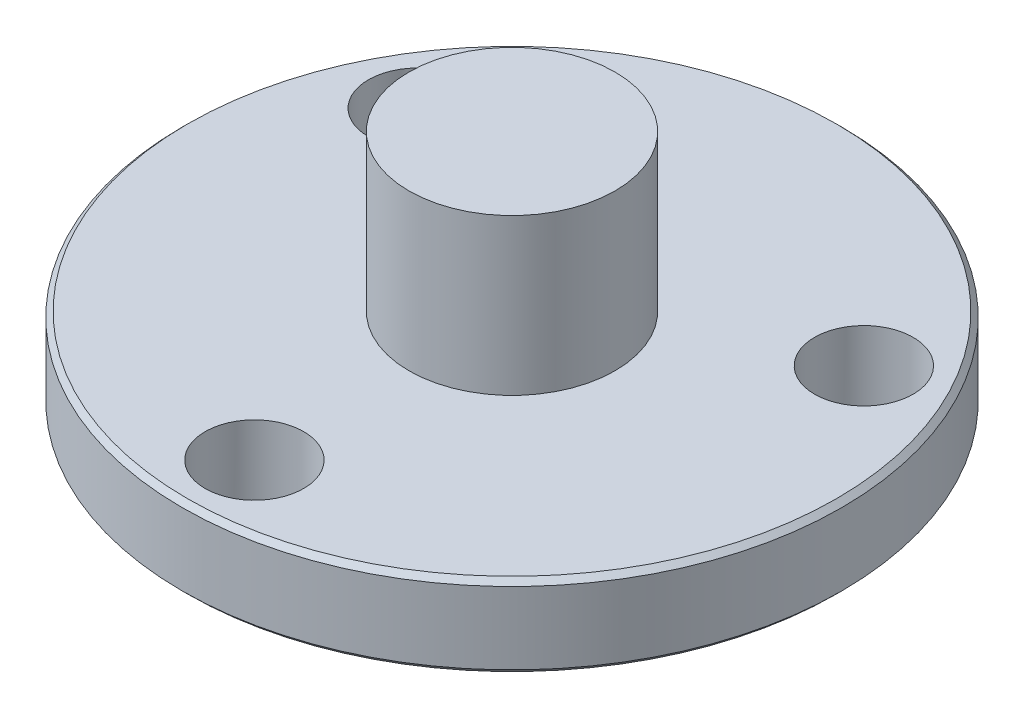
ISO-10303-21;
HEADER;
FILE_DESCRIPTION(('STEP AP214'),'2;1');
FILE_NAME('part.step','',(''),(''),'','','');
FILE_SCHEMA(('AUTOMOTIVE_DESIGN { 1 0 10303 214 1 1 1 1 }'));
ENDSEC;
DATA;
#1=APPLICATION_CONTEXT('core data for automotive mechanical design processes');
#2=APPLICATION_PROTOCOL_DEFINITION('international standard','automotive_design',2000,#1);
#3=PRODUCT_CONTEXT('',#1,'mechanical');
#4=PRODUCT('Part','Part','',(#3));
#5=PRODUCT_RELATED_PRODUCT_CATEGORY('part','',(#4));
#6=PRODUCT_DEFINITION_FORMATION('','',#4);
#7=PRODUCT_DEFINITION_CONTEXT('part definition',#1,'design');
#8=PRODUCT_DEFINITION('design','',#6,#7);
#9=PRODUCT_DEFINITION_SHAPE('','',#8);
#10=(LENGTH_UNIT() NAMED_UNIT(*) SI_UNIT(.MILLI.,.METRE.));
#11=(NAMED_UNIT(*) PLANE_ANGLE_UNIT() SI_UNIT($,.RADIAN.));
#12=(NAMED_UNIT(*) SI_UNIT($,.STERADIAN.) SOLID_ANGLE_UNIT());
#13=UNCERTAINTY_MEASURE_WITH_UNIT(LENGTH_MEASURE(1.E-05),#10,'distance_accuracy_value','');
#14=(GEOMETRIC_REPRESENTATION_CONTEXT(3) GLOBAL_UNCERTAINTY_ASSIGNED_CONTEXT((#13)) GLOBAL_UNIT_ASSIGNED_CONTEXT((#10,
#11,#12)) REPRESENTATION_CONTEXT('',''));
#15=CARTESIAN_POINT('',(0.,0.,0.));
#16=DIRECTION('',(0.,0.,1.));
#17=DIRECTION('',(1.,0.,0.));
#18=AXIS2_PLACEMENT_3D('',#15,#16,#17);
#19=CARTESIAN_POINT('',(0.,70.,0.));
#20=DIRECTION('',(0.,-1.,0.));
#21=DIRECTION('',(0.,0.,-1.));
#22=AXIS2_PLACEMENT_3D('',#19,#20,#21);
#23=CYLINDRICAL_SURFACE('',#22,3.96875);
#24=CARTESIAN_POINT('',(0.,18.49875,0.));
#25=DIRECTION('',(0.,-1.,0.));
#26=DIRECTION('',(0.,0.,-1.));
#27=AXIS2_PLACEMENT_3D('',#24,#25,#26);
#28=CIRCLE('',#27,3.96875);
#29=CARTESIAN_POINT('',(0.,18.49875,-3.96875));
#30=VERTEX_POINT('',#29);
#31=EDGE_CURVE('E53',#30,#30,#28,.T.);
#32=ORIENTED_EDGE('',*,*,#31,.F.);
#33=EDGE_LOOP('',(#32));
#34=FACE_BOUND('',#33,.T.);
#35=CARTESIAN_POINT('',(0.,24.49875,0.));
#36=DIRECTION('',(0.,1.,0.));
#37=DIRECTION('',(0.,0.,1.));
#38=AXIS2_PLACEMENT_3D('',#35,#36,#37);
#39=CIRCLE('',#38,3.96875);
#40=CARTESIAN_POINT('',(0.,24.49875,3.96875));
#41=VERTEX_POINT('',#40);
#42=EDGE_CURVE('E37',#41,#41,#39,.T.);
#43=ORIENTED_EDGE('',*,*,#42,.F.);
#44=EDGE_LOOP('',(#43));
#45=FACE_BOUND('',#44,.T.);
#46=ADVANCED_FACE('F33',(#34,#45),#23,.T.);
#47=CARTESIAN_POINT('',(0.,18.49875,0.));
#48=DIRECTION('',(0.,-1.,0.));
#49=DIRECTION('',(0.,0.,-1.));
#50=AXIS2_PLACEMENT_3D('',#47,#48,#49);
#51=PLANE('',#50);
#52=CARTESIAN_POINT('',(8.59259580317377,18.49875,-4.96093749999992));
#53=DIRECTION('',(0.,1.,0.));
#54=DIRECTION('',(0.,0.,1.));
#55=AXIS2_PLACEMENT_3D('',#52,#53,#54);
#56=CIRCLE('',#55,1.89865);
#57=CARTESIAN_POINT('',(8.59259580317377,18.49875,-3.06228749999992));
#58=VERTEX_POINT('',#57);
#59=EDGE_CURVE('E71',#58,#58,#56,.T.);
#60=ORIENTED_EDGE('',*,*,#59,.F.);
#61=EDGE_LOOP('',(#60));
#62=FACE_BOUND('',#61,.T.);
#63=CARTESIAN_POINT('',(-8.59259580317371,18.49875,-4.96093750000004));
#64=DIRECTION('',(0.,1.,0.));
#65=DIRECTION('',(0.,0.,1.));
#66=AXIS2_PLACEMENT_3D('',#63,#64,#65);
#67=CIRCLE('',#66,1.89865);
#68=CARTESIAN_POINT('',(-8.59259580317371,18.49875,-3.06228750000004));
#69=VERTEX_POINT('',#68);
#70=EDGE_CURVE('E65',#69,#69,#67,.T.);
#71=ORIENTED_EDGE('',*,*,#70,.F.);
#72=EDGE_LOOP('',(#71));
#73=FACE_BOUND('',#72,.T.);
#74=CARTESIAN_POINT('',(0.,18.49875,9.921875));
#75=DIRECTION('',(0.,1.,0.));
#76=DIRECTION('',(0.,0.,1.));
#77=AXIS2_PLACEMENT_3D('',#74,#75,#76);
#78=CIRCLE('',#77,1.89865);
#79=CARTESIAN_POINT('',(0.,18.49875,11.820525));
#80=VERTEX_POINT('',#79);
#81=EDGE_CURVE('E59',#80,#80,#78,.T.);
#82=ORIENTED_EDGE('',*,*,#81,.F.);
#83=EDGE_LOOP('',(#82));
#84=FACE_BOUND('',#83,.T.);
#85=CARTESIAN_POINT('',(0.,18.49875,0.));
#86=DIRECTION('',(0.,-1.,0.));
#87=DIRECTION('',(0.,0.,-1.));
#88=AXIS2_PLACEMENT_3D('',#85,#86,#87);
#89=CIRCLE('',#88,12.5);
#90=CARTESIAN_POINT('',(0.,18.49875,-12.5));
#91=VERTEX_POINT('',#90);
#92=EDGE_CURVE('E45',#91,#91,#89,.F.);
#93=ORIENTED_EDGE('',*,*,#92,.T.);
#94=EDGE_LOOP('',(#93));
#95=FACE_BOUND('',#94,.T.);
#96=ORIENTED_EDGE('',*,*,#31,.T.);
#97=EDGE_LOOP('',(#96));
#98=FACE_BOUND('',#97,.T.);
#99=ADVANCED_FACE('F81',(#62,#73,#84,#95,#98),#51,.F.);
#100=CARTESIAN_POINT('',(0.,15.31875,0.));
#101=DIRECTION('',(0.,-1.,0.));
#102=DIRECTION('',(0.,0.,-1.));
#103=AXIS2_PLACEMENT_3D('',#100,#101,#102);
#104=PLANE('',#103);
#105=CARTESIAN_POINT('',(8.59259580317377,15.31875,-4.96093749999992));
#106=DIRECTION('',(0.,-1.,0.));
#107=DIRECTION('',(0.,0.,-1.));
#108=AXIS2_PLACEMENT_3D('',#105,#106,#107);
#109=CIRCLE('',#108,1.89865);
#110=CARTESIAN_POINT('',(8.59259580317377,15.31875,-6.85958749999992));
#111=VERTEX_POINT('',#110);
#112=EDGE_CURVE('E68',#111,#111,#109,.T.);
#113=ORIENTED_EDGE('',*,*,#112,.F.);
#114=EDGE_LOOP('',(#113));
#115=FACE_BOUND('',#114,.T.);
#116=CARTESIAN_POINT('',(-8.59259580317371,15.31875,-4.96093750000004));
#117=DIRECTION('',(0.,-1.,0.));
#118=DIRECTION('',(0.,0.,-1.));
#119=AXIS2_PLACEMENT_3D('',#116,#117,#118);
#120=CIRCLE('',#119,1.89865);
#121=CARTESIAN_POINT('',(-8.59259580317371,15.31875,-6.85958750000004));
#122=VERTEX_POINT('',#121);
#123=EDGE_CURVE('E62',#122,#122,#120,.T.);
#124=ORIENTED_EDGE('',*,*,#123,.F.);
#125=EDGE_LOOP('',(#124));
#126=FACE_BOUND('',#125,.T.);
#127=CARTESIAN_POINT('',(0.,15.31875,9.921875));
#128=DIRECTION('',(0.,-1.,0.));
#129=DIRECTION('',(0.,0.,-1.));
#130=AXIS2_PLACEMENT_3D('',#127,#128,#129);
#131=CIRCLE('',#130,1.89865);
#132=CARTESIAN_POINT('',(0.,15.31875,8.023225));
#133=VERTEX_POINT('',#132);
#134=EDGE_CURVE('E56',#133,#133,#131,.T.);
#135=ORIENTED_EDGE('',*,*,#134,.F.);
#136=EDGE_LOOP('',(#135));
#137=FACE_BOUND('',#136,.T.);
#138=CARTESIAN_POINT('',(0.,15.31875,0.));
#139=DIRECTION('',(0.,-1.,0.));
#140=DIRECTION('',(0.,0.,-1.));
#141=AXIS2_PLACEMENT_3D('',#138,#139,#140);
#142=CIRCLE('',#141,12.5);
#143=CARTESIAN_POINT('',(0.,15.31875,-12.5));
#144=VERTEX_POINT('',#143);
#145=EDGE_CURVE('E41',#144,#144,#142,.T.);
#146=ORIENTED_EDGE('',*,*,#145,.T.);
#147=EDGE_LOOP('',(#146));
#148=FACE_BOUND('',#147,.T.);
#149=ADVANCED_FACE('F87',(#115,#126,#137,#148),#104,.T.);
#150=CARTESIAN_POINT('',(0.,18.49875,0.));
#151=DIRECTION('',(0.,-1.,0.));
#152=DIRECTION('',(0.,0.,-1.));
#153=AXIS2_PLACEMENT_3D('',#150,#151,#152);
#154=CYLINDRICAL_SURFACE('',#153,12.7);
#155=CARTESIAN_POINT('',(0.,15.51875,0.));
#156=DIRECTION('',(0.,-1.,0.));
#157=DIRECTION('',(0.,0.,-1.));
#158=AXIS2_PLACEMENT_3D('',#155,#156,#157);
#159=CIRCLE('',#158,12.7);
#160=CARTESIAN_POINT('',(0.,15.51875,-12.7));
#161=VERTEX_POINT('',#160);
#162=EDGE_CURVE('E10',#161,#161,#159,.F.);
#163=CARTESIAN_POINT('',(0.,18.29875,0.));
#164=DIRECTION('',(0.,-1.,0.));
#165=DIRECTION('',(0.,0.,-1.));
#166=AXIS2_PLACEMENT_3D('',#163,#164,#165);
#167=CIRCLE('',#166,12.7);
#168=CARTESIAN_POINT('',(0.,18.29875,-12.7));
#169=VERTEX_POINT('',#168);
#170=EDGE_CURVE('E50',#169,#169,#167,.T.);
#171=CARTESIAN_POINT('',(0.,15.51875,-12.7));
#172=CARTESIAN_POINT('',(0.,15.5477083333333,-12.7));
#173=CARTESIAN_POINT('',(0.,15.5766666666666,-12.7));
#174=CARTESIAN_POINT('',(0.,15.6345833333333,-12.7));
#175=CARTESIAN_POINT('',(0.,15.6635416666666,-12.7));
#176=CARTESIAN_POINT('',(0.,15.7214583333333,-12.7));
#177=CARTESIAN_POINT('',(0.,15.7504166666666,-12.7));
#178=CARTESIAN_POINT('',(0.,15.8083333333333,-12.7));
#179=CARTESIAN_POINT('',(0.,15.8372916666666,-12.7));
#180=CARTESIAN_POINT('',(0.,15.8952083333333,-12.7));
#181=CARTESIAN_POINT('',(0.,15.9241666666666,-12.7));
#182=CARTESIAN_POINT('',(0.,15.9820833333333,-12.7));
#183=CARTESIAN_POINT('',(0.,16.0110416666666,-12.7));
#184=CARTESIAN_POINT('',(0.,16.0689583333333,-12.7));
#185=CARTESIAN_POINT('',(0.,16.0979166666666,-12.7));
#186=CARTESIAN_POINT('',(0.,16.1558333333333,-12.7));
#187=CARTESIAN_POINT('',(0.,16.1847916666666,-12.7));
#188=CARTESIAN_POINT('',(0.,16.2427083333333,-12.7));
#189=CARTESIAN_POINT('',(0.,16.2716666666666,-12.7));
#190=CARTESIAN_POINT('',(0.,16.3295833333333,-12.7));
#191=CARTESIAN_POINT('',(0.,16.3585416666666,-12.7));
#192=CARTESIAN_POINT('',(0.,16.4164583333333,-12.7));
#193=CARTESIAN_POINT('',(0.,16.4454166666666,-12.7));
#194=CARTESIAN_POINT('',(0.,16.5033333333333,-12.7));
#195=CARTESIAN_POINT('',(0.,16.5322916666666,-12.7));
#196=CARTESIAN_POINT('',(0.,16.5902083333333,-12.7));
#197=CARTESIAN_POINT('',(0.,16.6191666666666,-12.7));
#198=CARTESIAN_POINT('',(0.,16.6770833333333,-12.7));
#199=CARTESIAN_POINT('',(0.,16.7060416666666,-12.7));
#200=CARTESIAN_POINT('',(0.,16.7639583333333,-12.7));
#201=CARTESIAN_POINT('',(0.,16.7929166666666,-12.7));
#202=CARTESIAN_POINT('',(0.,16.8508333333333,-12.7));
#203=CARTESIAN_POINT('',(0.,16.8797916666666,-12.7));
#204=CARTESIAN_POINT('',(0.,16.9377083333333,-12.7));
#205=CARTESIAN_POINT('',(0.,16.9666666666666,-12.7));
#206=CARTESIAN_POINT('',(0.,17.0245833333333,-12.7));
#207=CARTESIAN_POINT('',(0.,17.0535416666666,-12.7));
#208=CARTESIAN_POINT('',(0.,17.1114583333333,-12.7));
#209=CARTESIAN_POINT('',(0.,17.1404166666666,-12.7));
#210=CARTESIAN_POINT('',(0.,17.1983333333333,-12.7));
#211=CARTESIAN_POINT('',(0.,17.2272916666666,-12.7));
#212=CARTESIAN_POINT('',(0.,17.2852083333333,-12.7));
#213=CARTESIAN_POINT('',(0.,17.3141666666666,-12.7));
#214=CARTESIAN_POINT('',(0.,17.3720833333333,-12.7));
#215=CARTESIAN_POINT('',(0.,17.4010416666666,-12.7));
#216=CARTESIAN_POINT('',(0.,17.4589583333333,-12.7));
#217=CARTESIAN_POINT('',(0.,17.4879166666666,-12.7));
#218=CARTESIAN_POINT('',(0.,17.5458333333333,-12.7));
#219=CARTESIAN_POINT('',(0.,17.5747916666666,-12.7));
#220=CARTESIAN_POINT('',(0.,17.6327083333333,-12.7));
#221=CARTESIAN_POINT('',(0.,17.6616666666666,-12.7));
#222=CARTESIAN_POINT('',(0.,17.7195833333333,-12.7));
#223=CARTESIAN_POINT('',(0.,17.7485416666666,-12.7));
#224=CARTESIAN_POINT('',(0.,17.8064583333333,-12.7));
#225=CARTESIAN_POINT('',(0.,17.8354166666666,-12.7));
#226=CARTESIAN_POINT('',(0.,17.8933333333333,-12.7));
#227=CARTESIAN_POINT('',(0.,17.9222916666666,-12.7));
#228=CARTESIAN_POINT('',(0.,17.9802083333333,-12.7));
#229=CARTESIAN_POINT('',(0.,18.0091666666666,-12.7));
#230=CARTESIAN_POINT('',(0.,18.0670833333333,-12.7));
#231=CARTESIAN_POINT('',(0.,18.0960416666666,-12.7));
#232=CARTESIAN_POINT('',(0.,18.1539583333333,-12.7));
#233=CARTESIAN_POINT('',(0.,18.1829166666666,-12.7));
#234=CARTESIAN_POINT('',(0.,18.2408333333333,-12.7));
#235=CARTESIAN_POINT('',(0.,18.2697916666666,-12.7));
#236=CARTESIAN_POINT('',(0.,18.29875,-12.7));
#237=B_SPLINE_CURVE_WITH_KNOTS('',3,(#171,#172,#173,#174,#175,#176,#177,#178,#179,#180,#181,
#182,#183,#184,#185,#186,#187,#188,#189,#190,#191,#192,#193,#194,#195,#196,#197,#198,#199,#200,
#201,#202,#203,#204,#205,#206,#207,#208,#209,#210,#211,#212,#213,#214,#215,#216,#217,#218,#219,
#220,#221,#222,#223,#224,#225,#226,#227,#228,#229,#230,#231,#232,#233,#234,#235,#236),
.UNSPECIFIED.,.F.,.F.,(4,2,2,2,2,2,2,2,2,2,2,2,2,2,2,2,2,2,2,2,2,2,2,2,2,2,2,2,2,2,2,2,4),(0.,
0.0868750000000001,0.173750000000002,0.260625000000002,0.347500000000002,0.434375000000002,
0.521249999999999,0.608124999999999,0.694999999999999,0.781875,0.86875,0.955625,1.0425,1.129375,
1.21625,1.303125,1.39,1.476875,1.56375,1.650625,1.7375,1.824375,1.91125,1.998125,2.085,2.171875,
2.25875,2.345625,2.4325,2.519375,2.60625,2.693125,2.78),.UNSPECIFIED.);
#238=EDGE_CURVE('BSEAM92',#161,#169,#237,.T.);
#239=ORIENTED_EDGE('',*,*,#162,.T.);
#240=ORIENTED_EDGE('',*,*,#170,.T.);
#241=ORIENTED_EDGE('',*,*,#238,.T.);
#242=ORIENTED_EDGE('',*,*,#238,.F.);
#243=EDGE_LOOP('',(#239,#241,#240,#242));
#244=FACE_BOUND('',#243,.T.);
#245=ADVANCED_FACE('F92',(#244),#154,.T.);
#246=CARTESIAN_POINT('',(0.,18.29875,0.));
#247=DIRECTION('',(0.,-1.,0.));
#248=DIRECTION('',(0.,0.,-1.));
#249=AXIS2_PLACEMENT_3D('',#246,#247,#248);
#250=CONICAL_SURFACE('',#249,12.7,0.785398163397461);
#251=ORIENTED_EDGE('',*,*,#92,.F.);
#252=EDGE_LOOP('',(#251));
#253=FACE_BOUND('',#252,.T.);
#254=ORIENTED_EDGE('',*,*,#170,.F.);
#255=EDGE_LOOP('',(#254));
#256=FACE_BOUND('',#255,.T.);
#257=ADVANCED_FACE('F94',(#253,#256),#250,.T.);
#258=CARTESIAN_POINT('',(0.,15.31875,0.));
#259=DIRECTION('',(0.,1.,0.));
#260=DIRECTION('',(0.,0.,1.));
#261=AXIS2_PLACEMENT_3D('',#258,#259,#260);
#262=CONICAL_SURFACE('',#261,12.5,0.785398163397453);
#263=ORIENTED_EDGE('',*,*,#162,.F.);
#264=EDGE_LOOP('',(#263));
#265=FACE_BOUND('',#264,.T.);
#266=ORIENTED_EDGE('',*,*,#145,.F.);
#267=EDGE_LOOP('',(#266));
#268=FACE_BOUND('',#267,.T.);
#269=ADVANCED_FACE('F35',(#265,#268),#262,.T.);
#270=CARTESIAN_POINT('',(0.,18.49875,9.921875));
#271=DIRECTION('',(0.,1.,0.));
#272=DIRECTION('',(0.,0.,1.));
#273=AXIS2_PLACEMENT_3D('',#270,#271,#272);
#274=CYLINDRICAL_SURFACE('',#273,1.89865);
#275=ORIENTED_EDGE('',*,*,#134,.T.);
#276=EDGE_LOOP('',(#275));
#277=FACE_BOUND('',#276,.T.);
#278=ORIENTED_EDGE('',*,*,#81,.T.);
#279=EDGE_LOOP('',(#278));
#280=FACE_BOUND('',#279,.T.);
#281=ADVANCED_FACE('F101',(#277,#280),#274,.F.);
#282=CARTESIAN_POINT('',(-8.59259580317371,18.49875,-4.96093750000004));
#283=DIRECTION('',(0.,1.,0.));
#284=DIRECTION('',(0.,0.,1.));
#285=AXIS2_PLACEMENT_3D('',#282,#283,#284);
#286=CYLINDRICAL_SURFACE('',#285,1.89865);
#287=ORIENTED_EDGE('',*,*,#123,.T.);
#288=EDGE_LOOP('',(#287));
#289=FACE_BOUND('',#288,.T.);
#290=ORIENTED_EDGE('',*,*,#70,.T.);
#291=EDGE_LOOP('',(#290));
#292=FACE_BOUND('',#291,.T.);
#293=ADVANCED_FACE('F120',(#289,#292),#286,.F.);
#294=CARTESIAN_POINT('',(8.59259580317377,18.49875,-4.96093749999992));
#295=DIRECTION('',(0.,1.,0.));
#296=DIRECTION('',(0.,0.,1.));
#297=AXIS2_PLACEMENT_3D('',#294,#295,#296);
#298=CYLINDRICAL_SURFACE('',#297,1.89865);
#299=ORIENTED_EDGE('',*,*,#112,.T.);
#300=EDGE_LOOP('',(#299));
#301=FACE_BOUND('',#300,.T.);
#302=ORIENTED_EDGE('',*,*,#59,.T.);
#303=EDGE_LOOP('',(#302));
#304=FACE_BOUND('',#303,.T.);
#305=ADVANCED_FACE('F124',(#301,#304),#298,.F.);
#306=CARTESIAN_POINT('',(0.,24.49875,0.));
#307=DIRECTION('',(0.,1.,0.));
#308=DIRECTION('',(0.,0.,1.));
#309=AXIS2_PLACEMENT_3D('',#306,#307,#308);
#310=PLANE('',#309);
#311=ORIENTED_EDGE('',*,*,#42,.T.);
#312=EDGE_LOOP('',(#311));
#313=FACE_BOUND('',#312,.T.);
#314=ADVANCED_FACE('F78',(#313),#310,.T.);
#315=CLOSED_SHELL('',(#46,#99,#149,#245,#257,#269,#281,#293,#305,#314));
#316=MANIFOLD_SOLID_BREP('B2',#315);
#317=ADVANCED_BREP_SHAPE_REPRESENTATION('',(#18,#316),#14);
#318=SHAPE_DEFINITION_REPRESENTATION(#9,#317);
ENDSEC;
END-ISO-10303-21;
